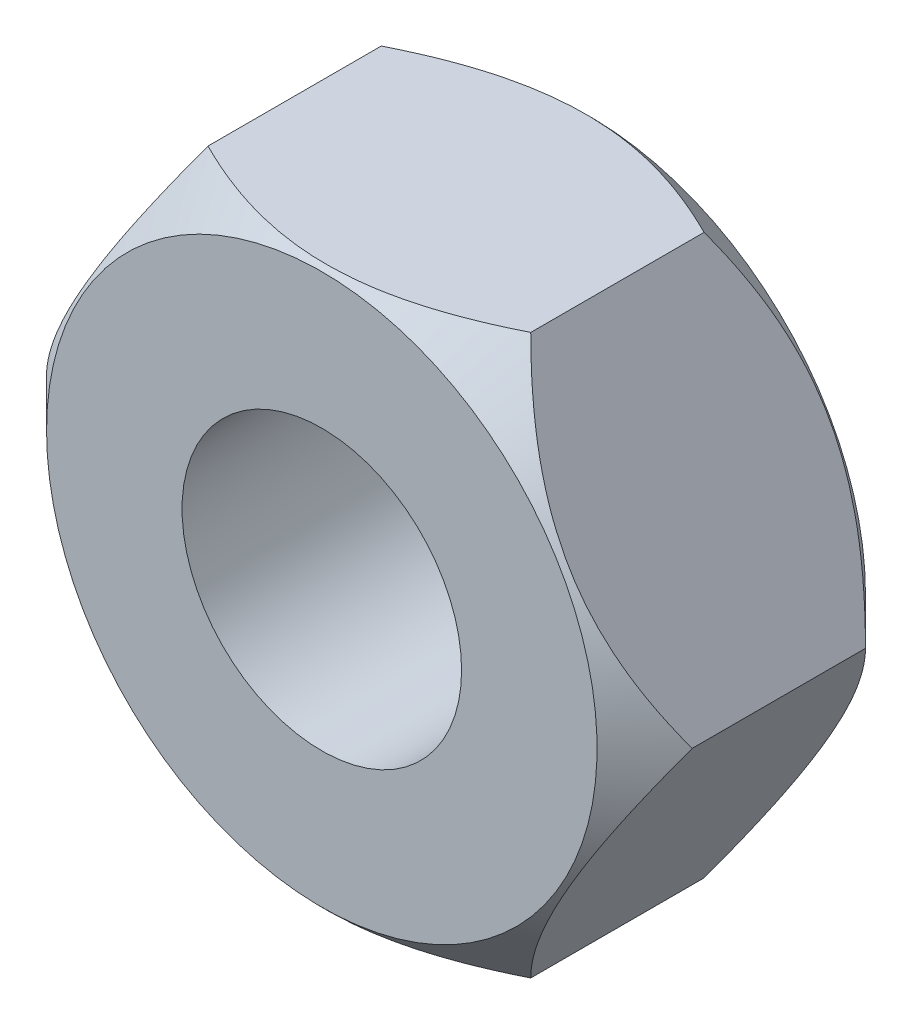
from build123d import *

# Parameters (mm, degrees)
BASE_EXTRUSION_DEPTH    = 4.8
ESQUISSE27_R            = 2.5
COUPER_EXTRUSION2_DEPTH = 10.020716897


with BuildPart() as part:
    # Esquisse26 → Base-Extrusion (new body)
    with BuildSketch(Plane.XY):
        Polygon((-2.886751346, 5), (2.886751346, 5), (5.773502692, 0), (2.886751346, -5), (-2.886751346, -5), (-5.773502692, 0), align=None)
    extrude(amount=-BASE_EXTRUSION_DEPTH)

    # Esquisse27 → Couper-Extrusion2 (cut, through all)
    with BuildSketch(Plane.XY):
        Circle(ESQUISSE27_R)
    extrude(amount=-COUPER_EXTRUSION2_DEPTH, mode=Mode.SUBTRACT)

    # Couper-Balayage4: sweep along a path in Esquisse38
    with BuildLine(Plane.XY) as couper_balayage4_path:
        CenterArc((0, 0), 3.5, 0, 360)
    # Esquisse37 → Couper-Balayage4 (sweep, cut)
    with BuildSketch(Plane(origin=(0, 0, 0), x_dir=(1, 0, 0), z_dir=(0, 1, 0))):
        Polygon((-5.773502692, 0), (-5.773502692, 0.85), (-4.923502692, 0), align=None)
    sweep(path=couper_balayage4_path.line, mode=Mode.SUBTRACT)

    # Couper-Balayage5: sweep along a path in Esquisse40
    with BuildLine(Plane(origin=(0, 0, -4.8), x_dir=(-1, 0, 0), z_dir=(0, 0, -1))) as couper_balayage5_path:
        CenterArc((0, 0), 3.5, 0, 360)
    # Esquisse39 → Couper-Balayage5 (sweep, cut)
    with BuildSketch(Plane(origin=(0, 0, 0), x_dir=(1, 0, 0), z_dir=(0, 1, 0))):
        Polygon((-5.773502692, 4.8), (-4.923502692, 4.8), (-5.773502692, 3.95), align=None)
    sweep(path=couper_balayage5_path.line, mode=Mode.SUBTRACT)


solid = part.part
